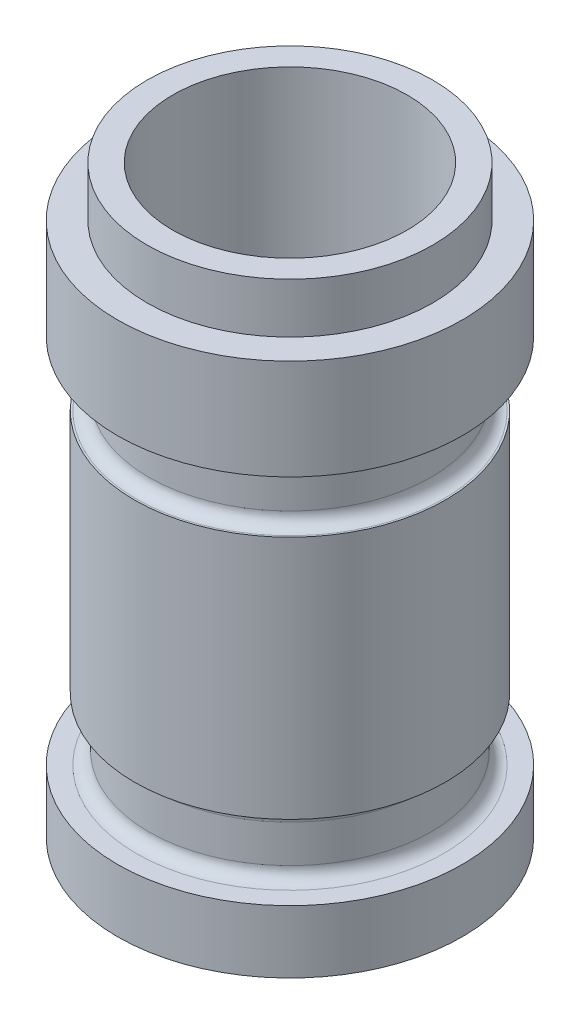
ISO-10303-21;
HEADER;
FILE_DESCRIPTION(('STEP AP214'),'2;1');
FILE_NAME('part.step','',(''),(''),'','','');
FILE_SCHEMA(('AUTOMOTIVE_DESIGN { 1 0 10303 214 1 1 1 1 }'));
ENDSEC;
DATA;
#1=APPLICATION_CONTEXT('core data for automotive mechanical design processes');
#2=APPLICATION_PROTOCOL_DEFINITION('international standard','automotive_design',2000,#1);
#3=PRODUCT_CONTEXT('',#1,'mechanical');
#4=PRODUCT('Part','Part','',(#3));
#5=PRODUCT_RELATED_PRODUCT_CATEGORY('part','',(#4));
#6=PRODUCT_DEFINITION_FORMATION('','',#4);
#7=PRODUCT_DEFINITION_CONTEXT('part definition',#1,'design');
#8=PRODUCT_DEFINITION('design','',#6,#7);
#9=PRODUCT_DEFINITION_SHAPE('','',#8);
#10=(LENGTH_UNIT() NAMED_UNIT(*) SI_UNIT(.MILLI.,.METRE.));
#11=(NAMED_UNIT(*) PLANE_ANGLE_UNIT() SI_UNIT($,.RADIAN.));
#12=(NAMED_UNIT(*) SI_UNIT($,.STERADIAN.) SOLID_ANGLE_UNIT());
#13=UNCERTAINTY_MEASURE_WITH_UNIT(LENGTH_MEASURE(1.E-05),#10,'distance_accuracy_value','');
#14=(GEOMETRIC_REPRESENTATION_CONTEXT(3) GLOBAL_UNCERTAINTY_ASSIGNED_CONTEXT((#13)) GLOBAL_UNIT_ASSIGNED_CONTEXT((#10,
#11,#12)) REPRESENTATION_CONTEXT('',''));
#15=CARTESIAN_POINT('',(0.,0.,0.));
#16=DIRECTION('',(0.,0.,1.));
#17=DIRECTION('',(1.,0.,0.));
#18=AXIS2_PLACEMENT_3D('',#15,#16,#17);
#19=CARTESIAN_POINT('',(0.,0.,0.));
#20=DIRECTION('',(0.,1.,0.));
#21=DIRECTION('',(0.,0.,1.));
#22=AXIS2_PLACEMENT_3D('',#19,#20,#21);
#23=PLANE('',#22);
#24=CARTESIAN_POINT('',(0.,0.,0.));
#25=DIRECTION('',(0.,1.,0.));
#26=DIRECTION('',(0.,0.,1.));
#27=AXIS2_PLACEMENT_3D('',#24,#25,#26);
#28=CIRCLE('',#27,2.75);
#29=CARTESIAN_POINT('',(0.,0.,2.75));
#30=VERTEX_POINT('',#29);
#31=EDGE_CURVE('E103',#30,#30,#28,.T.);
#32=ORIENTED_EDGE('',*,*,#31,.F.);
#33=EDGE_LOOP('',(#32));
#34=FACE_BOUND('',#33,.T.);
#35=ADVANCED_FACE('F32',(#34),#23,.F.);
#36=CARTESIAN_POINT('',(0.,0.987858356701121,0.));
#37=DIRECTION('',(0.,1.,0.));
#38=DIRECTION('',(0.,0.,1.));
#39=AXIS2_PLACEMENT_3D('',#36,#37,#38);
#40=CONICAL_SURFACE('',#39,1.37,1.22869669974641);
#41=CARTESIAN_POINT('',(0.,0.5,0.));
#42=VERTEX_POINT('',#41);
#43=VERTEX_LOOP('',#42);
#44=FACE_BOUND('',#43,.T.);
#45=CARTESIAN_POINT('',(0.,0.987858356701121,0.));
#46=DIRECTION('',(0.,1.,0.));
#47=DIRECTION('',(0.,0.,1.));
#48=AXIS2_PLACEMENT_3D('',#45,#46,#47);
#49=CIRCLE('',#48,1.37);
#50=CARTESIAN_POINT('',(0.,0.987858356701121,1.37));
#51=VERTEX_POINT('',#50);
#52=EDGE_CURVE('E11',#51,#51,#49,.T.);
#53=ORIENTED_EDGE('',*,*,#52,.T.);
#54=EDGE_LOOP('',(#53));
#55=FACE_BOUND('',#54,.T.);
#56=ADVANCED_FACE('F41',(#44,#55),#40,.F.);
#57=CARTESIAN_POINT('',(1.37,0.987858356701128,0.));
#58=DIRECTION('',(0.,-1.,0.));
#59=DIRECTION('',(0.,0.,-1.));
#60=AXIS2_PLACEMENT_3D('',#57,#58,#59);
#61=PLANE('',#60);
#62=ORIENTED_EDGE('',*,*,#52,.F.);
#63=EDGE_LOOP('',(#62));
#64=FACE_BOUND('',#63,.T.);
#65=CARTESIAN_POINT('',(0.,0.987858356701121,0.));
#66=DIRECTION('',(0.,1.,0.));
#67=DIRECTION('',(0.,0.,1.));
#68=AXIS2_PLACEMENT_3D('',#65,#66,#67);
#69=CIRCLE('',#68,1.87);
#70=CARTESIAN_POINT('',(0.,0.987858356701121,1.87));
#71=VERTEX_POINT('',#70);
#72=EDGE_CURVE('E38',#71,#71,#69,.T.);
#73=ORIENTED_EDGE('',*,*,#72,.T.);
#74=EDGE_LOOP('',(#73));
#75=FACE_BOUND('',#74,.T.);
#76=ADVANCED_FACE('F44',(#64,#75),#61,.F.);
#77=CARTESIAN_POINT('',(0.,236.22,0.));
#78=DIRECTION('',(0.,1.,0.));
#79=DIRECTION('',(0.,0.,1.));
#80=AXIS2_PLACEMENT_3D('',#77,#78,#79);
#81=CYLINDRICAL_SURFACE('',#80,1.87);
#82=ORIENTED_EDGE('',*,*,#72,.F.);
#83=EDGE_LOOP('',(#82));
#84=FACE_BOUND('',#83,.T.);
#85=CARTESIAN_POINT('',(0.,9.32400672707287,0.));
#86=DIRECTION('',(0.,1.,0.));
#87=DIRECTION('',(0.,0.,1.));
#88=AXIS2_PLACEMENT_3D('',#85,#86,#87);
#89=CIRCLE('',#88,1.87);
#90=CARTESIAN_POINT('',(0.,9.32400672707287,1.87));
#91=VERTEX_POINT('',#90);
#92=EDGE_CURVE('E54',#91,#91,#89,.T.);
#93=ORIENTED_EDGE('',*,*,#92,.T.);
#94=EDGE_LOOP('',(#93));
#95=FACE_BOUND('',#94,.T.);
#96=ADVANCED_FACE('F49',(#84,#95),#81,.F.);
#97=CARTESIAN_POINT('',(2.28,9.32400672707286,0.));
#98=DIRECTION('',(0.,-1.,0.));
#99=DIRECTION('',(0.,0.,-1.));
#100=AXIS2_PLACEMENT_3D('',#97,#98,#99);
#101=PLANE('',#100);
#102=ORIENTED_EDGE('',*,*,#92,.F.);
#103=EDGE_LOOP('',(#102));
#104=FACE_BOUND('',#103,.T.);
#105=CARTESIAN_POINT('',(0.,9.32400672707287,0.));
#106=DIRECTION('',(0.,1.,0.));
#107=DIRECTION('',(0.,0.,1.));
#108=AXIS2_PLACEMENT_3D('',#105,#106,#107);
#109=CIRCLE('',#108,2.28);
#110=CARTESIAN_POINT('',(0.,9.32400672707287,2.28));
#111=VERTEX_POINT('',#110);
#112=EDGE_CURVE('E56',#111,#111,#109,.T.);
#113=ORIENTED_EDGE('',*,*,#112,.T.);
#114=EDGE_LOOP('',(#113));
#115=FACE_BOUND('',#114,.T.);
#116=ADVANCED_FACE('F126',(#104,#115),#101,.F.);
#117=CARTESIAN_POINT('',(0.,236.22,0.));
#118=DIRECTION('',(0.,1.,0.));
#119=DIRECTION('',(0.,0.,1.));
#120=AXIS2_PLACEMENT_3D('',#117,#118,#119);
#121=CYLINDRICAL_SURFACE('',#120,2.28);
#122=ORIENTED_EDGE('',*,*,#112,.F.);
#123=EDGE_LOOP('',(#122));
#124=FACE_BOUND('',#123,.T.);
#125=CARTESIAN_POINT('',(0.,8.52400672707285,0.));
#126=DIRECTION('',(0.,1.,0.));
#127=DIRECTION('',(0.,0.,1.));
#128=AXIS2_PLACEMENT_3D('',#125,#126,#127);
#129=CIRCLE('',#128,2.28);
#130=CARTESIAN_POINT('',(0.,8.52400672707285,2.28));
#131=VERTEX_POINT('',#130);
#132=EDGE_CURVE('E61',#131,#131,#129,.T.);
#133=ORIENTED_EDGE('',*,*,#132,.T.);
#134=EDGE_LOOP('',(#133));
#135=FACE_BOUND('',#134,.T.);
#136=ADVANCED_FACE('F133',(#124,#135),#121,.T.);
#137=CARTESIAN_POINT('',(2.75,8.52400672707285,0.));
#138=DIRECTION('',(0.,-1.,0.));
#139=DIRECTION('',(0.,0.,-1.));
#140=AXIS2_PLACEMENT_3D('',#137,#138,#139);
#141=PLANE('',#140);
#142=ORIENTED_EDGE('',*,*,#132,.F.);
#143=EDGE_LOOP('',(#142));
#144=FACE_BOUND('',#143,.T.);
#145=CARTESIAN_POINT('',(0.,8.52400672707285,0.));
#146=DIRECTION('',(0.,1.,0.));
#147=DIRECTION('',(0.,0.,1.));
#148=AXIS2_PLACEMENT_3D('',#145,#146,#147);
#149=CIRCLE('',#148,2.75);
#150=CARTESIAN_POINT('',(0.,8.52400672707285,2.75));
#151=VERTEX_POINT('',#150);
#152=EDGE_CURVE('E64',#151,#151,#149,.T.);
#153=ORIENTED_EDGE('',*,*,#152,.T.);
#154=EDGE_LOOP('',(#153));
#155=FACE_BOUND('',#154,.T.);
#156=ADVANCED_FACE('F141',(#144,#155),#141,.F.);
#157=CARTESIAN_POINT('',(0.,236.22,0.));
#158=DIRECTION('',(0.,1.,0.));
#159=DIRECTION('',(0.,0.,1.));
#160=AXIS2_PLACEMENT_3D('',#157,#158,#159);
#161=CYLINDRICAL_SURFACE('',#160,2.75);
#162=ORIENTED_EDGE('',*,*,#152,.F.);
#163=EDGE_LOOP('',(#162));
#164=FACE_BOUND('',#163,.T.);
#165=CARTESIAN_POINT('',(0.,6.92400672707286,0.));
#166=DIRECTION('',(0.,1.,0.));
#167=DIRECTION('',(0.,0.,1.));
#168=AXIS2_PLACEMENT_3D('',#165,#166,#167);
#169=CIRCLE('',#168,2.75);
#170=CARTESIAN_POINT('',(0.,6.92400672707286,2.75));
#171=VERTEX_POINT('',#170);
#172=EDGE_CURVE('E67',#171,#171,#169,.T.);
#173=ORIENTED_EDGE('',*,*,#172,.T.);
#174=EDGE_LOOP('',(#173));
#175=FACE_BOUND('',#174,.T.);
#176=ADVANCED_FACE('F149',(#164,#175),#161,.T.);
#177=CARTESIAN_POINT('',(2.45,6.92400672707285,0.));
#178=DIRECTION('',(0.,1.,0.));
#179=DIRECTION('',(0.,0.,1.));
#180=AXIS2_PLACEMENT_3D('',#177,#178,#179);
#181=PLANE('',#180);
#182=ORIENTED_EDGE('',*,*,#172,.F.);
#183=EDGE_LOOP('',(#182));
#184=FACE_BOUND('',#183,.T.);
#185=CARTESIAN_POINT('',(0.,6.92400672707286,0.));
#186=DIRECTION('',(0.,1.,0.));
#187=DIRECTION('',(0.,0.,1.));
#188=AXIS2_PLACEMENT_3D('',#185,#186,#187);
#189=CIRCLE('',#188,2.45);
#190=CARTESIAN_POINT('',(0.,6.92400672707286,2.45));
#191=VERTEX_POINT('',#190);
#192=EDGE_CURVE('E70',#191,#191,#189,.T.);
#193=ORIENTED_EDGE('',*,*,#192,.T.);
#194=EDGE_LOOP('',(#193));
#195=FACE_BOUND('',#194,.T.);
#196=ADVANCED_FACE('F157',(#184,#195),#181,.F.);
#197=CARTESIAN_POINT('',(0.,6.72400672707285,0.));
#198=DIRECTION('',(0.,1.,0.));
#199=DIRECTION('',(0.,0.,1.));
#200=AXIS2_PLACEMENT_3D('',#197,#198,#199);
#201=TOROIDAL_SURFACE('',#200,2.45,0.200000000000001);
#202=ORIENTED_EDGE('',*,*,#192,.F.);
#203=EDGE_LOOP('',(#202));
#204=FACE_BOUND('',#203,.T.);
#205=CARTESIAN_POINT('',(0.,6.72400672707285,0.));
#206=DIRECTION('',(0.,1.,0.));
#207=DIRECTION('',(0.,0.,1.));
#208=AXIS2_PLACEMENT_3D('',#205,#206,#207);
#209=CIRCLE('',#208,2.25);
#210=CARTESIAN_POINT('',(0.,6.72400672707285,2.25));
#211=VERTEX_POINT('',#210);
#212=EDGE_CURVE('E73',#211,#211,#209,.T.);
#213=ORIENTED_EDGE('',*,*,#212,.T.);
#214=EDGE_LOOP('',(#213));
#215=FACE_BOUND('',#214,.T.);
#216=ADVANCED_FACE('F165',(#204,#215),#201,.F.);
#217=CARTESIAN_POINT('',(0.,236.22,0.));
#218=DIRECTION('',(0.,1.,0.));
#219=DIRECTION('',(0.,0.,1.));
#220=AXIS2_PLACEMENT_3D('',#217,#218,#219);
#221=CYLINDRICAL_SURFACE('',#220,2.25);
#222=ORIENTED_EDGE('',*,*,#212,.F.);
#223=EDGE_LOOP('',(#222));
#224=FACE_BOUND('',#223,.T.);
#225=CARTESIAN_POINT('',(0.,6.09999999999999,0.));
#226=DIRECTION('',(0.,1.,0.));
#227=DIRECTION('',(0.,0.,1.));
#228=AXIS2_PLACEMENT_3D('',#225,#226,#227);
#229=CIRCLE('',#228,2.25);
#230=CARTESIAN_POINT('',(0.,6.09999999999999,2.25));
#231=VERTEX_POINT('',#230);
#232=EDGE_CURVE('E76',#231,#231,#229,.T.);
#233=ORIENTED_EDGE('',*,*,#232,.T.);
#234=EDGE_LOOP('',(#233));
#235=FACE_BOUND('',#234,.T.);
#236=ADVANCED_FACE('F173',(#224,#235),#221,.T.);
#237=CARTESIAN_POINT('',(0.,6.09999999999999,0.));
#238=DIRECTION('',(0.,1.,0.));
#239=DIRECTION('',(0.,0.,1.));
#240=AXIS2_PLACEMENT_3D('',#237,#238,#239);
#241=TOROIDAL_SURFACE('',#240,2.45,0.199999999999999);
#242=ORIENTED_EDGE('',*,*,#232,.F.);
#243=EDGE_LOOP('',(#242));
#244=FACE_BOUND('',#243,.T.);
#245=CARTESIAN_POINT('',(0.,5.89999999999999,0.));
#246=DIRECTION('',(0.,1.,0.));
#247=DIRECTION('',(0.,0.,1.));
#248=AXIS2_PLACEMENT_3D('',#245,#246,#247);
#249=CIRCLE('',#248,2.45);
#250=CARTESIAN_POINT('',(0.,5.89999999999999,2.45));
#251=VERTEX_POINT('',#250);
#252=EDGE_CURVE('E79',#251,#251,#249,.T.);
#253=ORIENTED_EDGE('',*,*,#252,.T.);
#254=EDGE_LOOP('',(#253));
#255=FACE_BOUND('',#254,.T.);
#256=ADVANCED_FACE('F181',(#244,#255),#241,.F.);
#257=CARTESIAN_POINT('',(2.479,5.89999999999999,0.));
#258=DIRECTION('',(0.,-1.,0.));
#259=DIRECTION('',(0.,0.,-1.));
#260=AXIS2_PLACEMENT_3D('',#257,#258,#259);
#261=PLANE('',#260);
#262=ORIENTED_EDGE('',*,*,#252,.F.);
#263=EDGE_LOOP('',(#262));
#264=FACE_BOUND('',#263,.T.);
#265=CARTESIAN_POINT('',(0.,5.89999999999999,0.));
#266=DIRECTION('',(0.,1.,0.));
#267=DIRECTION('',(0.,0.,1.));
#268=AXIS2_PLACEMENT_3D('',#265,#266,#267);
#269=CIRCLE('',#268,2.479);
#270=CARTESIAN_POINT('',(0.,5.89999999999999,2.479));
#271=VERTEX_POINT('',#270);
#272=EDGE_CURVE('E82',#271,#271,#269,.T.);
#273=ORIENTED_EDGE('',*,*,#272,.T.);
#274=EDGE_LOOP('',(#273));
#275=FACE_BOUND('',#274,.T.);
#276=ADVANCED_FACE('F189',(#264,#275),#261,.F.);
#277=CARTESIAN_POINT('',(0.,236.22,0.));
#278=DIRECTION('',(0.,1.,0.));
#279=DIRECTION('',(0.,0.,1.));
#280=AXIS2_PLACEMENT_3D('',#277,#278,#279);
#281=CYLINDRICAL_SURFACE('',#280,2.479);
#282=ORIENTED_EDGE('',*,*,#272,.F.);
#283=EDGE_LOOP('',(#282));
#284=FACE_BOUND('',#283,.T.);
#285=CARTESIAN_POINT('',(0.,2.,0.));
#286=DIRECTION('',(0.,1.,0.));
#287=DIRECTION('',(0.,0.,1.));
#288=AXIS2_PLACEMENT_3D('',#285,#286,#287);
#289=CIRCLE('',#288,2.479);
#290=CARTESIAN_POINT('',(0.,2.,2.479));
#291=VERTEX_POINT('',#290);
#292=EDGE_CURVE('E85',#291,#291,#289,.T.);
#293=ORIENTED_EDGE('',*,*,#292,.T.);
#294=EDGE_LOOP('',(#293));
#295=FACE_BOUND('',#294,.T.);
#296=ADVANCED_FACE('F197',(#284,#295),#281,.T.);
#297=CARTESIAN_POINT('',(2.45,1.99999999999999,0.));
#298=DIRECTION('',(0.,1.,0.));
#299=DIRECTION('',(0.,0.,1.));
#300=AXIS2_PLACEMENT_3D('',#297,#298,#299);
#301=PLANE('',#300);
#302=ORIENTED_EDGE('',*,*,#292,.F.);
#303=EDGE_LOOP('',(#302));
#304=FACE_BOUND('',#303,.T.);
#305=CARTESIAN_POINT('',(0.,2.,0.));
#306=DIRECTION('',(0.,1.,0.));
#307=DIRECTION('',(0.,0.,1.));
#308=AXIS2_PLACEMENT_3D('',#305,#306,#307);
#309=CIRCLE('',#308,2.45);
#310=CARTESIAN_POINT('',(0.,2.,2.45));
#311=VERTEX_POINT('',#310);
#312=EDGE_CURVE('E88',#311,#311,#309,.T.);
#313=ORIENTED_EDGE('',*,*,#312,.T.);
#314=EDGE_LOOP('',(#313));
#315=FACE_BOUND('',#314,.T.);
#316=ADVANCED_FACE('F205',(#304,#315),#301,.F.);
#317=CARTESIAN_POINT('',(0.,1.79999999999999,0.));
#318=DIRECTION('',(0.,1.,0.));
#319=DIRECTION('',(0.,0.,1.));
#320=AXIS2_PLACEMENT_3D('',#317,#318,#319);
#321=TOROIDAL_SURFACE('',#320,2.45,0.2);
#322=ORIENTED_EDGE('',*,*,#312,.F.);
#323=EDGE_LOOP('',(#322));
#324=FACE_BOUND('',#323,.T.);
#325=CARTESIAN_POINT('',(0.,1.8,0.));
#326=DIRECTION('',(0.,1.,0.));
#327=DIRECTION('',(0.,0.,1.));
#328=AXIS2_PLACEMENT_3D('',#325,#326,#327);
#329=CIRCLE('',#328,2.25);
#330=CARTESIAN_POINT('',(0.,1.8,2.25));
#331=VERTEX_POINT('',#330);
#332=EDGE_CURVE('E91',#331,#331,#329,.T.);
#333=ORIENTED_EDGE('',*,*,#332,.T.);
#334=EDGE_LOOP('',(#333));
#335=FACE_BOUND('',#334,.T.);
#336=ADVANCED_FACE('F213',(#324,#335),#321,.F.);
#337=CARTESIAN_POINT('',(0.,236.22,0.));
#338=DIRECTION('',(0.,1.,0.));
#339=DIRECTION('',(0.,0.,1.));
#340=AXIS2_PLACEMENT_3D('',#337,#338,#339);
#341=CYLINDRICAL_SURFACE('',#340,2.25);
#342=ORIENTED_EDGE('',*,*,#332,.F.);
#343=EDGE_LOOP('',(#342));
#344=FACE_BOUND('',#343,.T.);
#345=CARTESIAN_POINT('',(0.,1.20000000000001,0.));
#346=DIRECTION('',(0.,1.,0.));
#347=DIRECTION('',(0.,0.,1.));
#348=AXIS2_PLACEMENT_3D('',#345,#346,#347);
#349=CIRCLE('',#348,2.25);
#350=CARTESIAN_POINT('',(0.,1.20000000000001,2.25));
#351=VERTEX_POINT('',#350);
#352=EDGE_CURVE('E94',#351,#351,#349,.T.);
#353=ORIENTED_EDGE('',*,*,#352,.T.);
#354=EDGE_LOOP('',(#353));
#355=FACE_BOUND('',#354,.T.);
#356=ADVANCED_FACE('F221',(#344,#355),#341,.T.);
#357=CARTESIAN_POINT('',(0.,1.2,0.));
#358=DIRECTION('',(0.,1.,0.));
#359=DIRECTION('',(0.,0.,1.));
#360=AXIS2_PLACEMENT_3D('',#357,#358,#359);
#361=TOROIDAL_SURFACE('',#360,2.45,0.2);
#362=ORIENTED_EDGE('',*,*,#352,.F.);
#363=EDGE_LOOP('',(#362));
#364=FACE_BOUND('',#363,.T.);
#365=CARTESIAN_POINT('',(0.,1.,0.));
#366=DIRECTION('',(0.,1.,0.));
#367=DIRECTION('',(0.,0.,1.));
#368=AXIS2_PLACEMENT_3D('',#365,#366,#367);
#369=CIRCLE('',#368,2.45);
#370=CARTESIAN_POINT('',(0.,1.,2.45));
#371=VERTEX_POINT('',#370);
#372=EDGE_CURVE('E97',#371,#371,#369,.T.);
#373=ORIENTED_EDGE('',*,*,#372,.T.);
#374=EDGE_LOOP('',(#373));
#375=FACE_BOUND('',#374,.T.);
#376=ADVANCED_FACE('F229',(#364,#375),#361,.F.);
#377=CARTESIAN_POINT('',(2.75,1.,0.));
#378=DIRECTION('',(0.,-1.,0.));
#379=DIRECTION('',(0.,0.,-1.));
#380=AXIS2_PLACEMENT_3D('',#377,#378,#379);
#381=PLANE('',#380);
#382=ORIENTED_EDGE('',*,*,#372,.F.);
#383=EDGE_LOOP('',(#382));
#384=FACE_BOUND('',#383,.T.);
#385=CARTESIAN_POINT('',(0.,1.,0.));
#386=DIRECTION('',(0.,1.,0.));
#387=DIRECTION('',(0.,0.,1.));
#388=AXIS2_PLACEMENT_3D('',#385,#386,#387);
#389=CIRCLE('',#388,2.75);
#390=CARTESIAN_POINT('',(0.,1.,2.75));
#391=VERTEX_POINT('',#390);
#392=EDGE_CURVE('E100',#391,#391,#389,.T.);
#393=ORIENTED_EDGE('',*,*,#392,.T.);
#394=EDGE_LOOP('',(#393));
#395=FACE_BOUND('',#394,.T.);
#396=ADVANCED_FACE('F237',(#384,#395),#381,.F.);
#397=CARTESIAN_POINT('',(0.,236.22,0.));
#398=DIRECTION('',(0.,1.,0.));
#399=DIRECTION('',(0.,0.,1.));
#400=AXIS2_PLACEMENT_3D('',#397,#398,#399);
#401=CYLINDRICAL_SURFACE('',#400,2.75);
#402=ORIENTED_EDGE('',*,*,#392,.F.);
#403=EDGE_LOOP('',(#402));
#404=FACE_BOUND('',#403,.T.);
#405=ORIENTED_EDGE('',*,*,#31,.T.);
#406=EDGE_LOOP('',(#405));
#407=FACE_BOUND('',#406,.T.);
#408=ADVANCED_FACE('F107',(#404,#407),#401,.T.);
#409=CLOSED_SHELL('',(#35,#56,#76,#96,#116,#136,#156,#176,#196,#216,#236,#256,#276,#296,#316,
#336,#356,#376,#396,#408));
#410=MANIFOLD_SOLID_BREP('B2',#409);
#411=ADVANCED_BREP_SHAPE_REPRESENTATION('',(#18,#410),#14);
#412=SHAPE_DEFINITION_REPRESENTATION(#9,#411);
ENDSEC;
END-ISO-10303-21;
